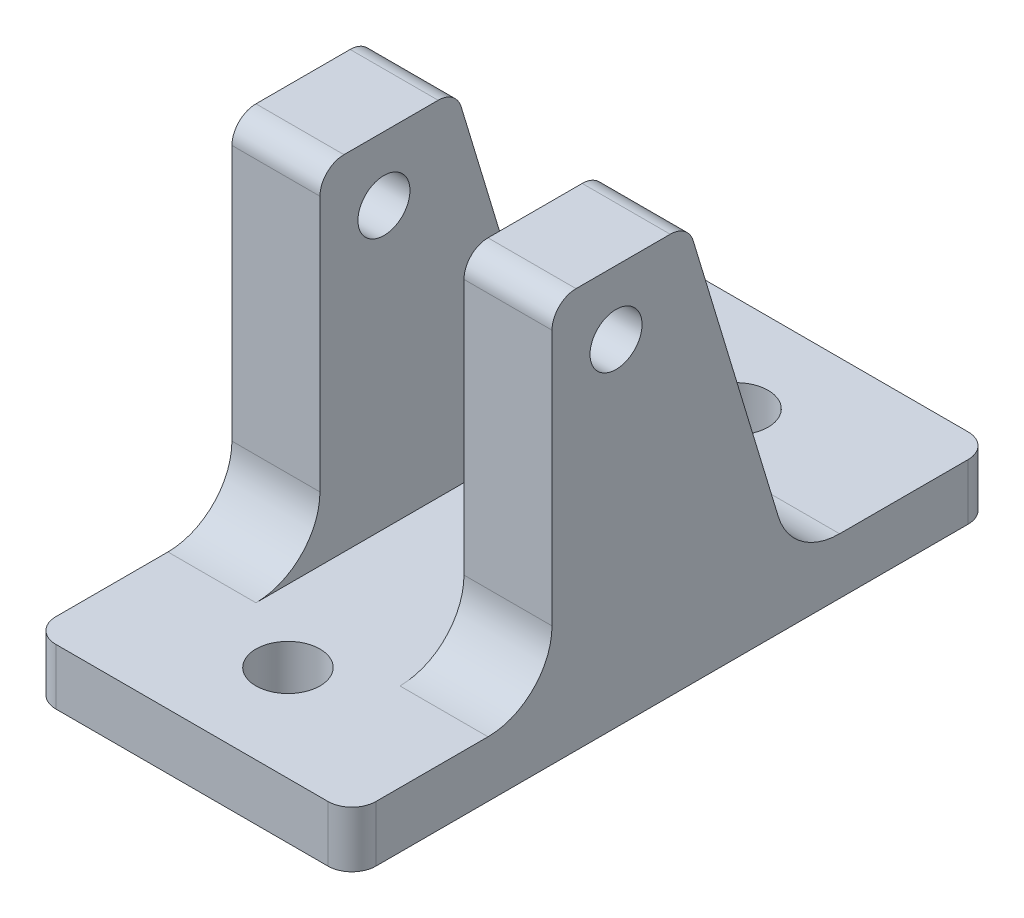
ISO-10303-21;
HEADER;
FILE_DESCRIPTION(('STEP AP214'),'2;1');
FILE_NAME('part.step','',(''),(''),'','','');
FILE_SCHEMA(('AUTOMOTIVE_DESIGN { 1 0 10303 214 1 1 1 1 }'));
ENDSEC;
DATA;
#1=APPLICATION_CONTEXT('core data for automotive mechanical design processes');
#2=APPLICATION_PROTOCOL_DEFINITION('international standard','automotive_design',2000,#1);
#3=PRODUCT_CONTEXT('',#1,'mechanical');
#4=PRODUCT('Part','Part','',(#3));
#5=PRODUCT_RELATED_PRODUCT_CATEGORY('part','',(#4));
#6=PRODUCT_DEFINITION_FORMATION('','',#4);
#7=PRODUCT_DEFINITION_CONTEXT('part definition',#1,'design');
#8=PRODUCT_DEFINITION('design','',#6,#7);
#9=PRODUCT_DEFINITION_SHAPE('','',#8);
#10=(LENGTH_UNIT() NAMED_UNIT(*) SI_UNIT(.MILLI.,.METRE.));
#11=(NAMED_UNIT(*) PLANE_ANGLE_UNIT() SI_UNIT($,.RADIAN.));
#12=(NAMED_UNIT(*) SI_UNIT($,.STERADIAN.) SOLID_ANGLE_UNIT());
#13=UNCERTAINTY_MEASURE_WITH_UNIT(LENGTH_MEASURE(1.E-05),#10,'distance_accuracy_value','');
#14=(GEOMETRIC_REPRESENTATION_CONTEXT(3) GLOBAL_UNCERTAINTY_ASSIGNED_CONTEXT((#13)) GLOBAL_UNIT_ASSIGNED_CONTEXT((#10,
#11,#12)) REPRESENTATION_CONTEXT('',''));
#15=CARTESIAN_POINT('',(0.,0.,0.));
#16=DIRECTION('',(0.,0.,1.));
#17=DIRECTION('',(1.,0.,0.));
#18=AXIS2_PLACEMENT_3D('',#15,#16,#17);
#19=CARTESIAN_POINT('',(0.,-505.422526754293,0.));
#20=DIRECTION('',(0.,-1.,0.));
#21=DIRECTION('',(0.,0.,-1.));
#22=AXIS2_PLACEMENT_3D('',#19,#20,#21);
#23=PLANE('',#22);
#24=CARTESIAN_POINT('',(-6.49999999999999,-505.422526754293,38.));
#25=DIRECTION('',(0.,-1.,0.));
#26=DIRECTION('',(1.,0.,0.));
#27=AXIS2_PLACEMENT_3D('',#24,#25,#26);
#28=CIRCLE('',#27,4.);
#29=CARTESIAN_POINT('',(-2.49999999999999,-505.422526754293,38.));
#30=VERTEX_POINT('',#29);
#31=EDGE_CURVE('E448',#30,#30,#28,.T.);
#32=ORIENTED_EDGE('',*,*,#31,.T.);
#33=EDGE_LOOP('',(#32));
#34=FACE_BOUND('',#33,.T.);
#35=DIRECTION('',(0.,0.,-1.));
#36=VECTOR('',#35,1.);
#37=CARTESIAN_POINT('',(-26.5,-505.422526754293,50.));
#38=LINE('',#37,#36);
#39=CARTESIAN_POINT('',(-26.5,-505.422526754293,47.));
#40=VERTEX_POINT('',#39);
#41=CARTESIAN_POINT('',(-26.5,-505.422526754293,33.));
#42=VERTEX_POINT('',#41);
#43=EDGE_CURVE('E223',#40,#42,#38,.T.);
#44=ORIENTED_EDGE('',*,*,#43,.F.);
#45=CARTESIAN_POINT('',(-23.5,-505.422526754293,47.));
#46=DIRECTION('',(0.,-1.,0.));
#47=DIRECTION('',(0.,0.,-1.));
#48=AXIS2_PLACEMENT_3D('',#45,#46,#47);
#49=CIRCLE('',#48,3.);
#50=CARTESIAN_POINT('',(-23.5,-505.422526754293,50.));
#51=VERTEX_POINT('',#50);
#52=EDGE_CURVE('E319',#40,#51,#49,.F.);
#53=ORIENTED_EDGE('',*,*,#52,.T.);
#54=DIRECTION('',(-1.,0.,0.));
#55=VECTOR('',#54,1.);
#56=CARTESIAN_POINT('',(-26.5,-505.422526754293,50.));
#57=LINE('',#56,#55);
#58=CARTESIAN_POINT('',(10.5,-505.422526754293,50.));
#59=VERTEX_POINT('',#58);
#60=EDGE_CURVE('E350',#59,#51,#57,.T.);
#61=ORIENTED_EDGE('',*,*,#60,.F.);
#62=CARTESIAN_POINT('',(10.5,-505.422526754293,47.));
#63=DIRECTION('',(0.,-1.,0.));
#64=DIRECTION('',(0.,0.,-1.));
#65=AXIS2_PLACEMENT_3D('',#62,#63,#64);
#66=CIRCLE('',#65,3.);
#67=CARTESIAN_POINT('',(13.5,-505.422526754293,47.));
#68=VERTEX_POINT('',#67);
#69=EDGE_CURVE('E318',#59,#68,#66,.F.);
#70=ORIENTED_EDGE('',*,*,#69,.T.);
#71=DIRECTION('',(0.,0.,1.));
#72=VECTOR('',#71,1.);
#73=CARTESIAN_POINT('',(13.5,-505.422526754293,50.));
#74=LINE('',#73,#72);
#75=CARTESIAN_POINT('',(13.5,-505.422526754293,33.));
#76=VERTEX_POINT('',#75);
#77=EDGE_CURVE('E360',#76,#68,#74,.T.);
#78=ORIENTED_EDGE('',*,*,#77,.F.);
#79=DIRECTION('',(1.,0.,0.));
#80=VECTOR('',#79,1.);
#81=CARTESIAN_POINT('',(2.50000000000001,-505.422526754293,33.));
#82=LINE('',#81,#80);
#83=CARTESIAN_POINT('',(2.50000000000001,-505.422526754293,33.));
#84=VERTEX_POINT('',#83);
#85=EDGE_CURVE('E243',#76,#84,#82,.F.);
#86=ORIENTED_EDGE('',*,*,#85,.T.);
#87=DIRECTION('',(0.,0.,-1.));
#88=VECTOR('',#87,1.);
#89=CARTESIAN_POINT('',(2.50000000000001,-505.422526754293,25.));
#90=LINE('',#89,#88);
#91=CARTESIAN_POINT('',(2.50000000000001,-505.422526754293,-10.9390055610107));
#92=VERTEX_POINT('',#91);
#93=EDGE_CURVE('E368',#84,#92,#90,.T.);
#94=ORIENTED_EDGE('',*,*,#93,.T.);
#95=DIRECTION('',(1.,0.,0.));
#96=VECTOR('',#95,1.);
#97=CARTESIAN_POINT('',(13.5,-505.422526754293,-10.9390055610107));
#98=LINE('',#97,#96);
#99=CARTESIAN_POINT('',(13.5,-505.422526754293,-10.9390055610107));
#100=VERTEX_POINT('',#99);
#101=EDGE_CURVE('E229',#92,#100,#98,.T.);
#102=ORIENTED_EDGE('',*,*,#101,.T.);
#103=DIRECTION('',(0.,0.,-1.));
#104=VECTOR('',#103,1.);
#105=CARTESIAN_POINT('',(13.5,-505.422526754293,-5.));
#106=LINE('',#105,#104);
#107=CARTESIAN_POINT('',(13.5,-505.422526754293,-27.));
#108=VERTEX_POINT('',#107);
#109=EDGE_CURVE('E423',#100,#108,#106,.T.);
#110=ORIENTED_EDGE('',*,*,#109,.T.);
#111=CARTESIAN_POINT('',(10.5,-505.422526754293,-27.));
#112=DIRECTION('',(0.,-1.,0.));
#113=DIRECTION('',(0.,0.,-1.));
#114=AXIS2_PLACEMENT_3D('',#111,#112,#113);
#115=CIRCLE('',#114,3.);
#116=CARTESIAN_POINT('',(10.5,-505.422526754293,-30.));
#117=VERTEX_POINT('',#116);
#118=EDGE_CURVE('E311',#108,#117,#115,.F.);
#119=ORIENTED_EDGE('',*,*,#118,.T.);
#120=DIRECTION('',(1.,0.,0.));
#121=VECTOR('',#120,1.);
#122=CARTESIAN_POINT('',(-26.5,-505.422526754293,-30.));
#123=LINE('',#122,#121);
#124=CARTESIAN_POINT('',(-23.5,-505.422526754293,-30.));
#125=VERTEX_POINT('',#124);
#126=EDGE_CURVE('E358',#125,#117,#123,.T.);
#127=ORIENTED_EDGE('',*,*,#126,.F.);
#128=CARTESIAN_POINT('',(-23.5,-505.422526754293,-27.));
#129=DIRECTION('',(0.,-1.,0.));
#130=DIRECTION('',(0.,0.,-1.));
#131=AXIS2_PLACEMENT_3D('',#128,#129,#130);
#132=CIRCLE('',#131,3.);
#133=CARTESIAN_POINT('',(-26.5,-505.422526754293,-27.));
#134=VERTEX_POINT('',#133);
#135=EDGE_CURVE('E316',#125,#134,#132,.F.);
#136=ORIENTED_EDGE('',*,*,#135,.T.);
#137=DIRECTION('',(0.,0.,-1.));
#138=VECTOR('',#137,1.);
#139=CARTESIAN_POINT('',(-26.5,-505.422526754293,-5.));
#140=LINE('',#139,#138);
#141=CARTESIAN_POINT('',(-26.5,-505.422526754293,-10.9390055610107));
#142=VERTEX_POINT('',#141);
#143=EDGE_CURVE('E412',#142,#134,#140,.T.);
#144=ORIENTED_EDGE('',*,*,#143,.F.);
#145=DIRECTION('',(1.,0.,0.));
#146=VECTOR('',#145,1.);
#147=CARTESIAN_POINT('',(-15.5,-505.422526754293,-10.9390055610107));
#148=LINE('',#147,#146);
#149=CARTESIAN_POINT('',(-15.5,-505.422526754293,-10.9390055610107));
#150=VERTEX_POINT('',#149);
#151=EDGE_CURVE('E234',#142,#150,#148,.T.);
#152=ORIENTED_EDGE('',*,*,#151,.T.);
#153=DIRECTION('',(0.,0.,-1.));
#154=VECTOR('',#153,1.);
#155=CARTESIAN_POINT('',(-15.5,-505.422526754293,25.));
#156=LINE('',#155,#154);
#157=CARTESIAN_POINT('',(-15.5,-505.422526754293,33.));
#158=VERTEX_POINT('',#157);
#159=EDGE_CURVE('E432',#158,#150,#156,.T.);
#160=ORIENTED_EDGE('',*,*,#159,.F.);
#161=DIRECTION('',(1.,0.,0.));
#162=VECTOR('',#161,1.);
#163=CARTESIAN_POINT('',(0.,-505.422526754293,33.));
#164=LINE('',#163,#162);
#165=EDGE_CURVE('E248',#158,#42,#164,.F.);
#166=ORIENTED_EDGE('',*,*,#165,.T.);
#167=EDGE_LOOP('',(#44,#53,#61,#70,#78,#86,#94,#102,#110,#119,#127,#136,#144,#152,#160,#166));
#168=FACE_BOUND('',#167,.T.);
#169=CARTESIAN_POINT('',(-6.49999999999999,-505.422526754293,-18.));
#170=DIRECTION('',(0.,-1.,0.));
#171=DIRECTION('',(1.,0.,0.));
#172=AXIS2_PLACEMENT_3D('',#169,#170,#171);
#173=CIRCLE('',#172,4.);
#174=CARTESIAN_POINT('',(-2.49999999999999,-505.422526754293,-18.));
#175=VERTEX_POINT('',#174);
#176=EDGE_CURVE('E445',#175,#175,#173,.T.);
#177=ORIENTED_EDGE('',*,*,#176,.T.);
#178=EDGE_LOOP('',(#177));
#179=FACE_BOUND('',#178,.T.);
#180=ADVANCED_FACE('F39',(#34,#168,#179),#23,.F.);
#181=CARTESIAN_POINT('',(2.50000000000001,-462.422526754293,25.));
#182=DIRECTION('',(0.,1.,0.));
#183=DIRECTION('',(0.,0.,1.));
#184=AXIS2_PLACEMENT_3D('',#181,#182,#183);
#185=PLANE('',#184);
#186=DIRECTION('',(0.,0.,-1.));
#187=VECTOR('',#186,1.);
#188=CARTESIAN_POINT('',(2.50000000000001,-462.422526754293,25.));
#189=LINE('',#188,#187);
#190=CARTESIAN_POINT('',(2.50000000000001,-462.422526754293,22.));
#191=VERTEX_POINT('',#190);
#192=CARTESIAN_POINT('',(2.50000000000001,-462.422526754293,10.227127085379));
#193=VERTEX_POINT('',#192);
#194=EDGE_CURVE('E369',#191,#193,#189,.T.);
#195=ORIENTED_EDGE('',*,*,#194,.F.);
#196=DIRECTION('',(1.,0.,0.));
#197=VECTOR('',#196,1.);
#198=CARTESIAN_POINT('',(13.5,-462.422526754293,22.));
#199=LINE('',#198,#197);
#200=CARTESIAN_POINT('',(13.5,-462.422526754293,22.));
#201=VERTEX_POINT('',#200);
#202=EDGE_CURVE('E293',#191,#201,#199,.T.);
#203=ORIENTED_EDGE('',*,*,#202,.T.);
#204=DIRECTION('',(0.,0.,-1.));
#205=VECTOR('',#204,1.);
#206=CARTESIAN_POINT('',(13.5,-462.422526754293,25.));
#207=LINE('',#206,#205);
#208=CARTESIAN_POINT('',(13.5,-462.422526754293,10.227127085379));
#209=VERTEX_POINT('',#208);
#210=EDGE_CURVE('E361',#201,#209,#207,.T.);
#211=ORIENTED_EDGE('',*,*,#210,.T.);
#212=DIRECTION('',(1.,0.,0.));
#213=VECTOR('',#212,1.);
#214=CARTESIAN_POINT('',(2.5,-462.422526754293,10.227127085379));
#215=LINE('',#214,#213);
#216=EDGE_CURVE('E291',#209,#193,#215,.F.);
#217=ORIENTED_EDGE('',*,*,#216,.T.);
#218=EDGE_LOOP('',(#195,#203,#211,#217));
#219=FACE_BOUND('',#218,.T.);
#220=ADVANCED_FACE('F397',(#219),#185,.T.);
#221=CARTESIAN_POINT('',(2.50000000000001,-505.422526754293,25.));
#222=DIRECTION('',(-1.,0.,0.));
#223=DIRECTION('',(0.,0.,1.));
#224=AXIS2_PLACEMENT_3D('',#221,#222,#223);
#225=PLANE('',#224);
#226=DIRECTION('',(0.,1.,0.));
#227=VECTOR('',#226,1.);
#228=CARTESIAN_POINT('',(2.50000000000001,-505.422526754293,25.));
#229=LINE('',#228,#227);
#230=CARTESIAN_POINT('',(2.50000000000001,-497.422526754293,25.));
#231=VERTEX_POINT('',#230);
#232=CARTESIAN_POINT('',(2.50000000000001,-465.422526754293,25.));
#233=VERTEX_POINT('',#232);
#234=EDGE_CURVE('E370',#231,#233,#229,.T.);
#235=ORIENTED_EDGE('',*,*,#234,.T.);
#236=CARTESIAN_POINT('',(2.50000000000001,-465.422526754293,22.));
#237=DIRECTION('',(-1.,0.,0.));
#238=DIRECTION('',(0.,0.,1.));
#239=AXIS2_PLACEMENT_3D('',#236,#237,#238);
#240=CIRCLE('',#239,3.);
#241=EDGE_CURVE('E309',#233,#191,#240,.T.);
#242=ORIENTED_EDGE('',*,*,#241,.T.);
#243=ORIENTED_EDGE('',*,*,#194,.T.);
#244=CARTESIAN_POINT('',(2.50000000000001,-465.422526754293,10.227127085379));
#245=DIRECTION('',(-1.,0.,0.));
#246=DIRECTION('',(0.,0.,1.));
#247=AXIS2_PLACEMENT_3D('',#244,#245,#246);
#248=CIRCLE('',#247,3.);
#249=CARTESIAN_POINT('',(2.50000000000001,-464.554358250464,7.35549280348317));
#250=VERTEX_POINT('',#249);
#251=EDGE_CURVE('E310',#193,#250,#248,.T.);
#252=ORIENTED_EDGE('',*,*,#251,.T.);
#253=DIRECTION('',(0.,0.957211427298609,0.289389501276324));
#254=VECTOR('',#253,1.);
#255=CARTESIAN_POINT('',(2.50000000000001,-497.112318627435,-2.48761149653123));
#256=LINE('',#255,#254);
#257=CARTESIAN_POINT('',(2.50000000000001,-499.737642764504,-3.28131414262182));
#258=VERTEX_POINT('',#257);
#259=EDGE_CURVE('E413',#258,#250,#256,.T.);
#260=ORIENTED_EDGE('',*,*,#259,.F.);
#261=CARTESIAN_POINT('',(2.50000000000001,-497.422526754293,-10.9390055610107));
#262=DIRECTION('',(-1.,0.,0.));
#263=DIRECTION('',(0.,0.,1.));
#264=AXIS2_PLACEMENT_3D('',#261,#262,#263);
#265=CIRCLE('',#264,8.);
#266=EDGE_CURVE('E270',#258,#92,#265,.F.);
#267=ORIENTED_EDGE('',*,*,#266,.T.);
#268=ORIENTED_EDGE('',*,*,#93,.F.);
#269=CARTESIAN_POINT('',(2.50000000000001,-497.422526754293,33.));
#270=DIRECTION('',(-1.,0.,0.));
#271=DIRECTION('',(0.,0.,1.));
#272=AXIS2_PLACEMENT_3D('',#269,#270,#271);
#273=CIRCLE('',#272,8.);
#274=EDGE_CURVE('E256',#84,#231,#273,.F.);
#275=ORIENTED_EDGE('',*,*,#274,.T.);
#276=EDGE_LOOP('',(#235,#242,#243,#252,#260,#267,#268,#275));
#277=FACE_BOUND('',#276,.T.);
#278=CARTESIAN_POINT('',(2.50000000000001,-470.422526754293,17.));
#279=DIRECTION('',(-1.,0.,0.));
#280=DIRECTION('',(0.,0.,1.));
#281=AXIS2_PLACEMENT_3D('',#278,#279,#280);
#282=CIRCLE('',#281,3.25);
#283=CARTESIAN_POINT('',(2.50000000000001,-470.422526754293,20.25));
#284=VERTEX_POINT('',#283);
#285=EDGE_CURVE('E436',#284,#284,#282,.T.);
#286=ORIENTED_EDGE('',*,*,#285,.F.);
#287=EDGE_LOOP('',(#286));
#288=FACE_BOUND('',#287,.T.);
#289=ADVANCED_FACE('F395',(#277,#288),#225,.T.);
#290=CARTESIAN_POINT('',(13.5,-462.422526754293,25.));
#291=DIRECTION('',(1.,0.,0.));
#292=DIRECTION('',(0.,1.,0.));
#293=AXIS2_PLACEMENT_3D('',#290,#291,#292);
#294=PLANE('',#293);
#295=ORIENTED_EDGE('',*,*,#210,.F.);
#296=CARTESIAN_POINT('',(13.5,-465.422526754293,22.));
#297=DIRECTION('',(1.,0.,0.));
#298=DIRECTION('',(0.,1.,0.));
#299=AXIS2_PLACEMENT_3D('',#296,#297,#298);
#300=CIRCLE('',#299,3.);
#301=CARTESIAN_POINT('',(13.5,-465.422526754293,25.));
#302=VERTEX_POINT('',#301);
#303=EDGE_CURVE('E301',#201,#302,#300,.T.);
#304=ORIENTED_EDGE('',*,*,#303,.T.);
#305=DIRECTION('',(0.,-1.,0.));
#306=VECTOR('',#305,1.);
#307=CARTESIAN_POINT('',(13.5,-462.422526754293,25.));
#308=LINE('',#307,#306);
#309=CARTESIAN_POINT('',(13.5,-497.422526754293,25.));
#310=VERTEX_POINT('',#309);
#311=EDGE_CURVE('E240',#302,#310,#308,.T.);
#312=ORIENTED_EDGE('',*,*,#311,.T.);
#313=CARTESIAN_POINT('',(13.5,-497.422526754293,33.));
#314=DIRECTION('',(1.,0.,0.));
#315=DIRECTION('',(0.,1.,0.));
#316=AXIS2_PLACEMENT_3D('',#313,#314,#315);
#317=CIRCLE('',#316,8.);
#318=EDGE_CURVE('E224',#310,#76,#317,.F.);
#319=ORIENTED_EDGE('',*,*,#318,.T.);
#320=ORIENTED_EDGE('',*,*,#77,.T.);
#321=DIRECTION('',(0.,1.,0.));
#322=VECTOR('',#321,1.);
#323=CARTESIAN_POINT('',(13.5,-512.422526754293,47.));
#324=LINE('',#323,#322);
#325=CARTESIAN_POINT('',(13.5,-512.422526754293,47.));
#326=VERTEX_POINT('',#325);
#327=EDGE_CURVE('E297',#68,#326,#324,.F.);
#328=ORIENTED_EDGE('',*,*,#327,.T.);
#329=DIRECTION('',(0.,0.,1.));
#330=VECTOR('',#329,1.);
#331=CARTESIAN_POINT('',(13.5,-512.422526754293,50.));
#332=LINE('',#331,#330);
#333=CARTESIAN_POINT('',(13.5,-512.422526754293,-27.));
#334=VERTEX_POINT('',#333);
#335=EDGE_CURVE('E454',#334,#326,#332,.T.);
#336=ORIENTED_EDGE('',*,*,#335,.F.);
#337=DIRECTION('',(0.,1.,0.));
#338=VECTOR('',#337,1.);
#339=CARTESIAN_POINT('',(13.5,-505.422526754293,-27.));
#340=LINE('',#339,#338);
#341=EDGE_CURVE('E298',#334,#108,#340,.T.);
#342=ORIENTED_EDGE('',*,*,#341,.T.);
#343=ORIENTED_EDGE('',*,*,#109,.F.);
#344=CARTESIAN_POINT('',(13.5,-497.422526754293,-10.9390055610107));
#345=DIRECTION('',(1.,0.,0.));
#346=DIRECTION('',(0.,1.,0.));
#347=AXIS2_PLACEMENT_3D('',#344,#345,#346);
#348=CIRCLE('',#347,8.);
#349=CARTESIAN_POINT('',(13.5,-499.737642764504,-3.28131414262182));
#350=VERTEX_POINT('',#349);
#351=EDGE_CURVE('E264',#100,#350,#348,.F.);
#352=ORIENTED_EDGE('',*,*,#351,.T.);
#353=DIRECTION('',(0.,-0.957211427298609,-0.289389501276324));
#354=VECTOR('',#353,1.);
#355=CARTESIAN_POINT('',(13.5,-462.422526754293,8.));
#356=LINE('',#355,#354);
#357=CARTESIAN_POINT('',(13.5,-464.554358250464,7.35549280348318));
#358=VERTEX_POINT('',#357);
#359=EDGE_CURVE('E405',#358,#350,#356,.T.);
#360=ORIENTED_EDGE('',*,*,#359,.F.);
#361=CARTESIAN_POINT('',(13.5,-465.422526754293,10.227127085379));
#362=DIRECTION('',(1.,0.,0.));
#363=DIRECTION('',(0.,1.,0.));
#364=AXIS2_PLACEMENT_3D('',#361,#362,#363);
#365=CIRCLE('',#364,3.);
#366=EDGE_CURVE('E303',#358,#209,#365,.T.);
#367=ORIENTED_EDGE('',*,*,#366,.T.);
#368=EDGE_LOOP('',(#295,#304,#312,#319,#320,#328,#336,#342,#343,#352,#360,#367));
#369=FACE_BOUND('',#368,.T.);
#370=CARTESIAN_POINT('',(13.5000000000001,-470.422526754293,17.));
#371=DIRECTION('',(1.,0.,0.));
#372=DIRECTION('',(0.,1.,0.));
#373=AXIS2_PLACEMENT_3D('',#370,#371,#372);
#374=CIRCLE('',#373,3.25);
#375=CARTESIAN_POINT('',(13.5000000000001,-467.172526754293,17.));
#376=VERTEX_POINT('',#375);
#377=EDGE_CURVE('E429',#376,#376,#374,.T.);
#378=ORIENTED_EDGE('',*,*,#377,.F.);
#379=EDGE_LOOP('',(#378));
#380=FACE_BOUND('',#379,.T.);
#381=ADVANCED_FACE('F376',(#369,#380),#294,.T.);
#382=CARTESIAN_POINT('',(0.,0.,25.));
#383=DIRECTION('',(0.,0.,-1.));
#384=DIRECTION('',(-1.,0.,0.));
#385=AXIS2_PLACEMENT_3D('',#382,#383,#384);
#386=PLANE('',#385);
#387=ORIENTED_EDGE('',*,*,#311,.F.);
#388=DIRECTION('',(1.,0.,0.));
#389=VECTOR('',#388,1.);
#390=CARTESIAN_POINT('',(2.50000000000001,-465.422526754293,25.));
#391=LINE('',#390,#389);
#392=EDGE_CURVE('E304',#302,#233,#391,.F.);
#393=ORIENTED_EDGE('',*,*,#392,.T.);
#394=ORIENTED_EDGE('',*,*,#234,.F.);
#395=DIRECTION('',(1.,0.,0.));
#396=VECTOR('',#395,1.);
#397=CARTESIAN_POINT('',(13.5,-497.422526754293,25.));
#398=LINE('',#397,#396);
#399=EDGE_CURVE('E246',#231,#310,#398,.T.);
#400=ORIENTED_EDGE('',*,*,#399,.T.);
#401=EDGE_LOOP('',(#387,#393,#394,#400));
#402=FACE_BOUND('',#401,.T.);
#403=ADVANCED_FACE('F386',(#402),#386,.F.);
#404=CARTESIAN_POINT('',(0.,-512.422526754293,0.));
#405=DIRECTION('',(0.,-1.,0.));
#406=DIRECTION('',(0.,0.,-1.));
#407=AXIS2_PLACEMENT_3D('',#404,#405,#406);
#408=PLANE('',#407);
#409=CARTESIAN_POINT('',(-6.49999999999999,-512.422526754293,38.));
#410=DIRECTION('',(0.,-1.,0.));
#411=DIRECTION('',(1.,0.,0.));
#412=AXIS2_PLACEMENT_3D('',#409,#410,#411);
#413=CIRCLE('',#412,4.);
#414=CARTESIAN_POINT('',(-2.49999999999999,-512.422526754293,38.));
#415=VERTEX_POINT('',#414);
#416=EDGE_CURVE('E447',#415,#415,#413,.T.);
#417=ORIENTED_EDGE('',*,*,#416,.F.);
#418=EDGE_LOOP('',(#417));
#419=FACE_BOUND('',#418,.T.);
#420=DIRECTION('',(-1.,0.,0.));
#421=VECTOR('',#420,1.);
#422=CARTESIAN_POINT('',(-26.5,-512.422526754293,50.));
#423=LINE('',#422,#421);
#424=CARTESIAN_POINT('',(10.5,-512.422526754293,50.));
#425=VERTEX_POINT('',#424);
#426=CARTESIAN_POINT('',(-23.5,-512.422526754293,50.));
#427=VERTEX_POINT('',#426);
#428=EDGE_CURVE('E337',#425,#427,#423,.T.);
#429=ORIENTED_EDGE('',*,*,#428,.T.);
#430=CARTESIAN_POINT('',(-23.5,-512.422526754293,47.));
#431=DIRECTION('',(0.,-1.,0.));
#432=DIRECTION('',(0.,0.,-1.));
#433=AXIS2_PLACEMENT_3D('',#430,#431,#432);
#434=CIRCLE('',#433,3.);
#435=CARTESIAN_POINT('',(-26.5,-512.422526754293,47.));
#436=VERTEX_POINT('',#435);
#437=EDGE_CURVE('E332',#427,#436,#434,.T.);
#438=ORIENTED_EDGE('',*,*,#437,.T.);
#439=DIRECTION('',(0.,0.,-1.));
#440=VECTOR('',#439,1.);
#441=CARTESIAN_POINT('',(-26.5,-512.422526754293,50.));
#442=LINE('',#441,#440);
#443=CARTESIAN_POINT('',(-26.5,-512.422526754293,-27.));
#444=VERTEX_POINT('',#443);
#445=EDGE_CURVE('E336',#436,#444,#442,.T.);
#446=ORIENTED_EDGE('',*,*,#445,.T.);
#447=CARTESIAN_POINT('',(-23.5,-512.422526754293,-27.));
#448=DIRECTION('',(0.,-1.,0.));
#449=DIRECTION('',(0.,0.,-1.));
#450=AXIS2_PLACEMENT_3D('',#447,#448,#449);
#451=CIRCLE('',#450,3.);
#452=CARTESIAN_POINT('',(-23.5,-512.422526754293,-30.));
#453=VERTEX_POINT('',#452);
#454=EDGE_CURVE('E58',#444,#453,#451,.T.);
#455=ORIENTED_EDGE('',*,*,#454,.T.);
#456=DIRECTION('',(1.,0.,0.));
#457=VECTOR('',#456,1.);
#458=CARTESIAN_POINT('',(-26.5,-512.422526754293,-30.));
#459=LINE('',#458,#457);
#460=CARTESIAN_POINT('',(10.5,-512.422526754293,-30.));
#461=VERTEX_POINT('',#460);
#462=EDGE_CURVE('E346',#453,#461,#459,.T.);
#463=ORIENTED_EDGE('',*,*,#462,.T.);
#464=CARTESIAN_POINT('',(10.5,-512.422526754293,-27.));
#465=DIRECTION('',(0.,-1.,0.));
#466=DIRECTION('',(0.,0.,-1.));
#467=AXIS2_PLACEMENT_3D('',#464,#465,#466);
#468=CIRCLE('',#467,3.);
#469=EDGE_CURVE('E330',#461,#334,#468,.T.);
#470=ORIENTED_EDGE('',*,*,#469,.T.);
#471=ORIENTED_EDGE('',*,*,#335,.T.);
#472=CARTESIAN_POINT('',(10.5,-512.422526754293,47.));
#473=DIRECTION('',(0.,-1.,0.));
#474=DIRECTION('',(0.,0.,-1.));
#475=AXIS2_PLACEMENT_3D('',#472,#473,#474);
#476=CIRCLE('',#475,3.);
#477=EDGE_CURVE('E329',#326,#425,#476,.T.);
#478=ORIENTED_EDGE('',*,*,#477,.T.);
#479=EDGE_LOOP('',(#429,#438,#446,#455,#463,#470,#471,#478));
#480=FACE_BOUND('',#479,.T.);
#481=CARTESIAN_POINT('',(-6.49999999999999,-512.422526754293,-18.));
#482=DIRECTION('',(0.,-1.,0.));
#483=DIRECTION('',(1.,0.,0.));
#484=AXIS2_PLACEMENT_3D('',#481,#482,#483);
#485=CIRCLE('',#484,4.);
#486=CARTESIAN_POINT('',(-2.49999999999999,-512.422526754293,-18.));
#487=VERTEX_POINT('',#486);
#488=EDGE_CURVE('E443',#487,#487,#485,.T.);
#489=ORIENTED_EDGE('',*,*,#488,.F.);
#490=EDGE_LOOP('',(#489));
#491=FACE_BOUND('',#490,.T.);
#492=ADVANCED_FACE('F338',(#419,#480,#491),#408,.T.);
#493=CARTESIAN_POINT('',(-26.5,-512.422526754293,50.));
#494=DIRECTION('',(1.,0.,0.));
#495=DIRECTION('',(0.,1.,0.));
#496=AXIS2_PLACEMENT_3D('',#493,#494,#495);
#497=PLANE('',#496);
#498=DIRECTION('',(0.,-1.,0.));
#499=VECTOR('',#498,1.);
#500=CARTESIAN_POINT('',(-26.5,-462.422526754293,25.));
#501=LINE('',#500,#499);
#502=CARTESIAN_POINT('',(-26.5,-465.422526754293,25.));
#503=VERTEX_POINT('',#502);
#504=CARTESIAN_POINT('',(-26.5,-497.422526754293,25.));
#505=VERTEX_POINT('',#504);
#506=EDGE_CURVE('E201',#503,#505,#501,.T.);
#507=ORIENTED_EDGE('',*,*,#506,.F.);
#508=CARTESIAN_POINT('',(-26.5,-465.422526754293,22.));
#509=DIRECTION('',(1.,0.,0.));
#510=DIRECTION('',(0.,1.,0.));
#511=AXIS2_PLACEMENT_3D('',#508,#509,#510);
#512=CIRCLE('',#511,3.);
#513=CARTESIAN_POINT('',(-26.5,-462.422526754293,22.));
#514=VERTEX_POINT('',#513);
#515=EDGE_CURVE('E287',#503,#514,#512,.F.);
#516=ORIENTED_EDGE('',*,*,#515,.T.);
#517=DIRECTION('',(0.,0.,-1.));
#518=VECTOR('',#517,1.);
#519=CARTESIAN_POINT('',(-26.5,-462.422526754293,25.));
#520=LINE('',#519,#518);
#521=CARTESIAN_POINT('',(-26.5,-462.422526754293,10.227127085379));
#522=VERTEX_POINT('',#521);
#523=EDGE_CURVE('E430',#514,#522,#520,.T.);
#524=ORIENTED_EDGE('',*,*,#523,.T.);
#525=CARTESIAN_POINT('',(-26.5,-465.422526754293,10.227127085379));
#526=DIRECTION('',(1.,0.,0.));
#527=DIRECTION('',(0.,1.,0.));
#528=AXIS2_PLACEMENT_3D('',#525,#526,#527);
#529=CIRCLE('',#528,3.);
#530=CARTESIAN_POINT('',(-26.5,-464.554358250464,7.35549280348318));
#531=VERTEX_POINT('',#530);
#532=EDGE_CURVE('E281',#522,#531,#529,.F.);
#533=ORIENTED_EDGE('',*,*,#532,.T.);
#534=DIRECTION('',(0.,-0.957211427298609,-0.289389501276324));
#535=VECTOR('',#534,1.);
#536=CARTESIAN_POINT('',(-26.5,-462.422526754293,8.));
#537=LINE('',#536,#535);
#538=CARTESIAN_POINT('',(-26.5,-499.737642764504,-3.28131414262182));
#539=VERTEX_POINT('',#538);
#540=EDGE_CURVE('E419',#531,#539,#537,.T.);
#541=ORIENTED_EDGE('',*,*,#540,.T.);
#542=CARTESIAN_POINT('',(-26.5,-497.422526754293,-10.9390055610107));
#543=DIRECTION('',(1.,0.,0.));
#544=DIRECTION('',(0.,1.,0.));
#545=AXIS2_PLACEMENT_3D('',#542,#543,#544);
#546=CIRCLE('',#545,8.);
#547=EDGE_CURVE('E265',#539,#142,#546,.T.);
#548=ORIENTED_EDGE('',*,*,#547,.T.);
#549=ORIENTED_EDGE('',*,*,#143,.T.);
#550=DIRECTION('',(0.,1.,0.));
#551=VECTOR('',#550,1.);
#552=CARTESIAN_POINT('',(-26.5,-512.422526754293,-27.));
#553=LINE('',#552,#551);
#554=EDGE_CURVE('E279',#134,#444,#553,.F.);
#555=ORIENTED_EDGE('',*,*,#554,.T.);
#556=ORIENTED_EDGE('',*,*,#445,.F.);
#557=DIRECTION('',(0.,1.,0.));
#558=VECTOR('',#557,1.);
#559=CARTESIAN_POINT('',(-26.5,-512.422526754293,47.));
#560=LINE('',#559,#558);
#561=EDGE_CURVE('E285',#436,#40,#560,.T.);
#562=ORIENTED_EDGE('',*,*,#561,.T.);
#563=ORIENTED_EDGE('',*,*,#43,.T.);
#564=CARTESIAN_POINT('',(-26.5,-497.422526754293,33.));
#565=DIRECTION('',(1.,0.,0.));
#566=DIRECTION('',(0.,1.,0.));
#567=AXIS2_PLACEMENT_3D('',#564,#565,#566);
#568=CIRCLE('',#567,8.);
#569=EDGE_CURVE('E216',#42,#505,#568,.T.);
#570=ORIENTED_EDGE('',*,*,#569,.T.);
#571=EDGE_LOOP('',(#507,#516,#524,#533,#541,#548,#549,#555,#556,#562,#563,#570));
#572=FACE_BOUND('',#571,.T.);
#573=CARTESIAN_POINT('',(-26.5,-470.422526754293,17.));
#574=DIRECTION('',(1.,0.,0.));
#575=DIRECTION('',(0.,1.,0.));
#576=AXIS2_PLACEMENT_3D('',#573,#574,#575);
#577=CIRCLE('',#576,3.25);
#578=CARTESIAN_POINT('',(-26.5,-467.172526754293,17.));
#579=VERTEX_POINT('',#578);
#580=EDGE_CURVE('E414',#579,#579,#577,.T.);
#581=ORIENTED_EDGE('',*,*,#580,.T.);
#582=EDGE_LOOP('',(#581));
#583=FACE_BOUND('',#582,.T.);
#584=ADVANCED_FACE('F220',(#572,#583),#497,.F.);
#585=CARTESIAN_POINT('',(-26.5,-512.422526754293,-30.));
#586=DIRECTION('',(0.,0.,1.));
#587=DIRECTION('',(1.,0.,0.));
#588=AXIS2_PLACEMENT_3D('',#585,#586,#587);
#589=PLANE('',#588);
#590=ORIENTED_EDGE('',*,*,#462,.F.);
#591=DIRECTION('',(0.,1.,0.));
#592=VECTOR('',#591,1.);
#593=CARTESIAN_POINT('',(-23.5,-512.422526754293,-30.));
#594=LINE('',#593,#592);
#595=EDGE_CURVE('E11',#453,#125,#594,.T.);
#596=ORIENTED_EDGE('',*,*,#595,.T.);
#597=ORIENTED_EDGE('',*,*,#126,.T.);
#598=DIRECTION('',(0.,1.,0.));
#599=VECTOR('',#598,1.);
#600=CARTESIAN_POINT('',(10.5,-512.422526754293,-30.));
#601=LINE('',#600,#599);
#602=EDGE_CURVE('E50',#117,#461,#601,.F.);
#603=ORIENTED_EDGE('',*,*,#602,.T.);
#604=EDGE_LOOP('',(#590,#596,#597,#603));
#605=FACE_BOUND('',#604,.T.);
#606=ADVANCED_FACE('F458',(#605),#589,.F.);
#607=CARTESIAN_POINT('',(-26.5,-512.422526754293,50.));
#608=DIRECTION('',(0.,0.,-1.));
#609=DIRECTION('',(-1.,0.,0.));
#610=AXIS2_PLACEMENT_3D('',#607,#608,#609);
#611=PLANE('',#610);
#612=ORIENTED_EDGE('',*,*,#60,.T.);
#613=DIRECTION('',(0.,1.,0.));
#614=VECTOR('',#613,1.);
#615=CARTESIAN_POINT('',(-23.5,-512.422526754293,50.));
#616=LINE('',#615,#614);
#617=EDGE_CURVE('E324',#51,#427,#616,.F.);
#618=ORIENTED_EDGE('',*,*,#617,.T.);
#619=ORIENTED_EDGE('',*,*,#428,.F.);
#620=DIRECTION('',(0.,1.,0.));
#621=VECTOR('',#620,1.);
#622=CARTESIAN_POINT('',(10.5,-505.422526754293,50.));
#623=LINE('',#622,#621);
#624=EDGE_CURVE('E325',#425,#59,#623,.T.);
#625=ORIENTED_EDGE('',*,*,#624,.T.);
#626=EDGE_LOOP('',(#612,#618,#619,#625));
#627=FACE_BOUND('',#626,.T.);
#628=ADVANCED_FACE('F354',(#627),#611,.F.);
#629=CARTESIAN_POINT('',(-6.49999999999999,-512.422526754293,38.));
#630=DIRECTION('',(0.,1.,0.));
#631=DIRECTION('',(-1.,0.,0.));
#632=AXIS2_PLACEMENT_3D('',#629,#630,#631);
#633=CYLINDRICAL_SURFACE('',#632,4.);
#634=ORIENTED_EDGE('',*,*,#416,.T.);
#635=EDGE_LOOP('',(#634));
#636=FACE_BOUND('',#635,.T.);
#637=ORIENTED_EDGE('',*,*,#31,.F.);
#638=EDGE_LOOP('',(#637));
#639=FACE_BOUND('',#638,.T.);
#640=ADVANCED_FACE('F508',(#636,#639),#633,.F.);
#641=CARTESIAN_POINT('',(-6.49999999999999,-512.422526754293,-18.));
#642=DIRECTION('',(0.,1.,0.));
#643=DIRECTION('',(-1.,0.,0.));
#644=AXIS2_PLACEMENT_3D('',#641,#642,#643);
#645=CYLINDRICAL_SURFACE('',#644,4.);
#646=ORIENTED_EDGE('',*,*,#488,.T.);
#647=EDGE_LOOP('',(#646));
#648=FACE_BOUND('',#647,.T.);
#649=ORIENTED_EDGE('',*,*,#176,.F.);
#650=EDGE_LOOP('',(#649));
#651=FACE_BOUND('',#650,.T.);
#652=ADVANCED_FACE('F671',(#648,#651),#645,.F.);
#653=CARTESIAN_POINT('',(-26.5,-470.422526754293,17.));
#654=DIRECTION('',(1.,0.,0.));
#655=DIRECTION('',(0.,1.,0.));
#656=AXIS2_PLACEMENT_3D('',#653,#654,#655);
#657=CYLINDRICAL_SURFACE('',#656,3.25);
#658=ORIENTED_EDGE('',*,*,#285,.T.);
#659=EDGE_LOOP('',(#658));
#660=FACE_BOUND('',#659,.T.);
#661=ORIENTED_EDGE('',*,*,#377,.T.);
#662=EDGE_LOOP('',(#661));
#663=FACE_BOUND('',#662,.T.);
#664=ADVANCED_FACE('F665',(#660,#663),#657,.F.);
#665=CARTESIAN_POINT('',(-26.5,-462.422526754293,25.));
#666=DIRECTION('',(0.,1.,0.));
#667=DIRECTION('',(0.,0.,1.));
#668=AXIS2_PLACEMENT_3D('',#665,#666,#667);
#669=PLANE('',#668);
#670=ORIENTED_EDGE('',*,*,#523,.F.);
#671=DIRECTION('',(1.,0.,0.));
#672=VECTOR('',#671,1.);
#673=CARTESIAN_POINT('',(-26.5,-462.422526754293,22.));
#674=LINE('',#673,#672);
#675=CARTESIAN_POINT('',(-15.5,-462.422526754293,22.));
#676=VERTEX_POINT('',#675);
#677=EDGE_CURVE('E275',#514,#676,#674,.T.);
#678=ORIENTED_EDGE('',*,*,#677,.T.);
#679=DIRECTION('',(0.,0.,-1.));
#680=VECTOR('',#679,1.);
#681=CARTESIAN_POINT('',(-15.5,-462.422526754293,25.));
#682=LINE('',#681,#680);
#683=CARTESIAN_POINT('',(-15.5,-462.422526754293,10.227127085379));
#684=VERTEX_POINT('',#683);
#685=EDGE_CURVE('E215',#676,#684,#682,.T.);
#686=ORIENTED_EDGE('',*,*,#685,.T.);
#687=DIRECTION('',(1.,0.,0.));
#688=VECTOR('',#687,1.);
#689=CARTESIAN_POINT('',(-26.5,-462.422526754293,10.227127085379));
#690=LINE('',#689,#688);
#691=EDGE_CURVE('E269',#684,#522,#690,.F.);
#692=ORIENTED_EDGE('',*,*,#691,.T.);
#693=EDGE_LOOP('',(#670,#678,#686,#692));
#694=FACE_BOUND('',#693,.T.);
#695=ADVANCED_FACE('F649',(#694),#669,.T.);
#696=CARTESIAN_POINT('',(-15.5,-505.422526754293,25.));
#697=DIRECTION('',(-1.,0.,0.));
#698=DIRECTION('',(0.,0.,1.));
#699=AXIS2_PLACEMENT_3D('',#696,#697,#698);
#700=PLANE('',#699);
#701=CARTESIAN_POINT('',(-15.5,-470.422526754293,17.));
#702=DIRECTION('',(-1.,0.,0.));
#703=DIRECTION('',(0.,0.,1.));
#704=AXIS2_PLACEMENT_3D('',#701,#702,#703);
#705=CIRCLE('',#704,3.25);
#706=CARTESIAN_POINT('',(-15.5,-470.422526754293,20.25));
#707=VERTEX_POINT('',#706);
#708=EDGE_CURVE('E418',#707,#707,#705,.T.);
#709=ORIENTED_EDGE('',*,*,#708,.T.);
#710=EDGE_LOOP('',(#709));
#711=FACE_BOUND('',#710,.T.);
#712=ORIENTED_EDGE('',*,*,#685,.F.);
#713=CARTESIAN_POINT('',(-15.5,-465.422526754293,22.));
#714=DIRECTION('',(-1.,0.,0.));
#715=DIRECTION('',(0.,0.,1.));
#716=AXIS2_PLACEMENT_3D('',#713,#714,#715);
#717=CIRCLE('',#716,3.);
#718=CARTESIAN_POINT('',(-15.5,-465.422526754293,25.));
#719=VERTEX_POINT('',#718);
#720=EDGE_CURVE('E280',#676,#719,#717,.F.);
#721=ORIENTED_EDGE('',*,*,#720,.T.);
#722=DIRECTION('',(0.,1.,0.));
#723=VECTOR('',#722,1.);
#724=CARTESIAN_POINT('',(-15.5,-505.422526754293,25.));
#725=LINE('',#724,#723);
#726=CARTESIAN_POINT('',(-15.5,-497.422526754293,25.));
#727=VERTEX_POINT('',#726);
#728=EDGE_CURVE('E214',#727,#719,#725,.T.);
#729=ORIENTED_EDGE('',*,*,#728,.F.);
#730=CARTESIAN_POINT('',(-15.5,-497.422526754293,33.));
#731=DIRECTION('',(-1.,0.,0.));
#732=DIRECTION('',(0.,0.,1.));
#733=AXIS2_PLACEMENT_3D('',#730,#731,#732);
#734=CIRCLE('',#733,8.);
#735=EDGE_CURVE('E228',#727,#158,#734,.T.);
#736=ORIENTED_EDGE('',*,*,#735,.T.);
#737=ORIENTED_EDGE('',*,*,#159,.T.);
#738=CARTESIAN_POINT('',(-15.5,-497.422526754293,-10.9390055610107));
#739=DIRECTION('',(-1.,0.,0.));
#740=DIRECTION('',(0.,0.,1.));
#741=AXIS2_PLACEMENT_3D('',#738,#739,#740);
#742=CIRCLE('',#741,8.);
#743=CARTESIAN_POINT('',(-15.5,-499.737642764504,-3.28131414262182));
#744=VERTEX_POINT('',#743);
#745=EDGE_CURVE('E259',#150,#744,#742,.T.);
#746=ORIENTED_EDGE('',*,*,#745,.T.);
#747=DIRECTION('',(0.,0.957211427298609,0.289389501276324));
#748=VECTOR('',#747,1.);
#749=CARTESIAN_POINT('',(-15.5,-497.112318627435,-2.48761149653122));
#750=LINE('',#749,#748);
#751=CARTESIAN_POINT('',(-15.5,-464.554358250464,7.35549280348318));
#752=VERTEX_POINT('',#751);
#753=EDGE_CURVE('E232',#744,#752,#750,.T.);
#754=ORIENTED_EDGE('',*,*,#753,.T.);
#755=CARTESIAN_POINT('',(-15.5,-465.422526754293,10.227127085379));
#756=DIRECTION('',(-1.,0.,0.));
#757=DIRECTION('',(0.,0.,1.));
#758=AXIS2_PLACEMENT_3D('',#755,#756,#757);
#759=CIRCLE('',#758,3.);
#760=EDGE_CURVE('E274',#752,#684,#759,.F.);
#761=ORIENTED_EDGE('',*,*,#760,.T.);
#762=EDGE_LOOP('',(#712,#721,#729,#736,#737,#746,#754,#761));
#763=FACE_BOUND('',#762,.T.);
#764=ADVANCED_FACE('F637',(#711,#763),#700,.F.);
#765=CARTESIAN_POINT('',(0.,0.,25.));
#766=DIRECTION('',(0.,0.,1.));
#767=DIRECTION('',(1.,0.,0.));
#768=AXIS2_PLACEMENT_3D('',#765,#766,#767);
#769=PLANE('',#768);
#770=ORIENTED_EDGE('',*,*,#728,.T.);
#771=DIRECTION('',(1.,0.,0.));
#772=VECTOR('',#771,1.);
#773=CARTESIAN_POINT('',(0.,-465.422526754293,25.));
#774=LINE('',#773,#772);
#775=EDGE_CURVE('E206',#719,#503,#774,.F.);
#776=ORIENTED_EDGE('',*,*,#775,.T.);
#777=ORIENTED_EDGE('',*,*,#506,.T.);
#778=DIRECTION('',(1.,0.,0.));
#779=VECTOR('',#778,1.);
#780=CARTESIAN_POINT('',(0.,-497.422526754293,25.));
#781=LINE('',#780,#779);
#782=EDGE_CURVE('E207',#505,#727,#781,.T.);
#783=ORIENTED_EDGE('',*,*,#782,.T.);
#784=EDGE_LOOP('',(#770,#776,#777,#783));
#785=FACE_BOUND('',#784,.T.);
#786=ADVANCED_FACE('F203',(#785),#769,.T.);
#787=CARTESIAN_POINT('',(-26.5,-470.422526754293,17.));
#788=DIRECTION('',(1.,0.,0.));
#789=DIRECTION('',(0.,1.,0.));
#790=AXIS2_PLACEMENT_3D('',#787,#788,#789);
#791=CYLINDRICAL_SURFACE('',#790,3.25);
#792=ORIENTED_EDGE('',*,*,#580,.F.);
#793=EDGE_LOOP('',(#792));
#794=FACE_BOUND('',#793,.T.);
#795=ORIENTED_EDGE('',*,*,#708,.F.);
#796=EDGE_LOOP('',(#795));
#797=FACE_BOUND('',#796,.T.);
#798=ADVANCED_FACE('F616',(#794,#797),#791,.F.);
#799=CARTESIAN_POINT('',(-26.5,-462.422526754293,8.));
#800=DIRECTION('',(0.,-0.289389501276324,0.957211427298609));
#801=DIRECTION('',(0.,-0.957211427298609,-0.289389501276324));
#802=AXIS2_PLACEMENT_3D('',#799,#800,#801);
#803=PLANE('',#802);
#804=ORIENTED_EDGE('',*,*,#540,.F.);
#805=DIRECTION('',(1.,0.,0.));
#806=VECTOR('',#805,1.);
#807=CARTESIAN_POINT('',(-15.5,-464.554358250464,7.35549280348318));
#808=LINE('',#807,#806);
#809=EDGE_CURVE('E289',#531,#752,#808,.T.);
#810=ORIENTED_EDGE('',*,*,#809,.T.);
#811=ORIENTED_EDGE('',*,*,#753,.F.);
#812=DIRECTION('',(1.,0.,0.));
#813=VECTOR('',#812,1.);
#814=CARTESIAN_POINT('',(-26.5,-499.737642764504,-3.28131414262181));
#815=LINE('',#814,#813);
#816=EDGE_CURVE('E253',#744,#539,#815,.F.);
#817=ORIENTED_EDGE('',*,*,#816,.T.);
#818=EDGE_LOOP('',(#804,#810,#811,#817));
#819=FACE_BOUND('',#818,.T.);
#820=ADVANCED_FACE('F485',(#819),#803,.F.);
#821=ORIENTED_EDGE('',*,*,#259,.T.);
#822=DIRECTION('',(1.,0.,0.));
#823=VECTOR('',#822,1.);
#824=CARTESIAN_POINT('',(13.5,-464.554358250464,7.35549280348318));
#825=LINE('',#824,#823);
#826=EDGE_CURVE('E312',#250,#358,#825,.T.);
#827=ORIENTED_EDGE('',*,*,#826,.T.);
#828=ORIENTED_EDGE('',*,*,#359,.T.);
#829=DIRECTION('',(1.,0.,0.));
#830=VECTOR('',#829,1.);
#831=CARTESIAN_POINT('',(2.5,-499.737642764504,-3.28131414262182));
#832=LINE('',#831,#830);
#833=EDGE_CURVE('E252',#350,#258,#832,.F.);
#834=ORIENTED_EDGE('',*,*,#833,.T.);
#835=EDGE_LOOP('',(#821,#827,#828,#834));
#836=FACE_BOUND('',#835,.T.);
#837=ADVANCED_FACE('F410',(#836),#803,.F.);
#838=CARTESIAN_POINT('',(0.,-497.422526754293,33.));
#839=DIRECTION('',(1.,0.,0.));
#840=DIRECTION('',(0.,0.,-1.));
#841=AXIS2_PLACEMENT_3D('',#838,#839,#840);
#842=CYLINDRICAL_SURFACE('',#841,8.);
#843=ORIENTED_EDGE('',*,*,#569,.F.);
#844=ORIENTED_EDGE('',*,*,#165,.F.);
#845=ORIENTED_EDGE('',*,*,#735,.F.);
#846=ORIENTED_EDGE('',*,*,#782,.F.);
#847=EDGE_LOOP('',(#843,#844,#845,#846));
#848=FACE_BOUND('',#847,.T.);
#849=ADVANCED_FACE('F226',(#848),#842,.F.);
#850=CARTESIAN_POINT('',(0.,-497.422526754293,33.));
#851=DIRECTION('',(-1.,0.,0.));
#852=DIRECTION('',(0.,0.,1.));
#853=AXIS2_PLACEMENT_3D('',#850,#851,#852);
#854=CYLINDRICAL_SURFACE('',#853,8.);
#855=ORIENTED_EDGE('',*,*,#274,.F.);
#856=ORIENTED_EDGE('',*,*,#85,.F.);
#857=ORIENTED_EDGE('',*,*,#318,.F.);
#858=ORIENTED_EDGE('',*,*,#399,.F.);
#859=EDGE_LOOP('',(#855,#856,#857,#858));
#860=FACE_BOUND('',#859,.T.);
#861=ADVANCED_FACE('F390',(#860),#854,.F.);
#862=CARTESIAN_POINT('',(0.,-497.422526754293,-10.9390055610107));
#863=DIRECTION('',(-1.,0.,0.));
#864=DIRECTION('',(0.,0.,1.));
#865=AXIS2_PLACEMENT_3D('',#862,#863,#864);
#866=CYLINDRICAL_SURFACE('',#865,8.);
#867=ORIENTED_EDGE('',*,*,#547,.F.);
#868=ORIENTED_EDGE('',*,*,#816,.F.);
#869=ORIENTED_EDGE('',*,*,#745,.F.);
#870=ORIENTED_EDGE('',*,*,#151,.F.);
#871=EDGE_LOOP('',(#867,#868,#869,#870));
#872=FACE_BOUND('',#871,.T.);
#873=ADVANCED_FACE('F486',(#872),#866,.F.);
#874=CARTESIAN_POINT('',(0.,-497.422526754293,-10.9390055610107));
#875=DIRECTION('',(-1.,0.,0.));
#876=DIRECTION('',(0.,0.,1.));
#877=AXIS2_PLACEMENT_3D('',#874,#875,#876);
#878=CYLINDRICAL_SURFACE('',#877,8.);
#879=ORIENTED_EDGE('',*,*,#266,.F.);
#880=ORIENTED_EDGE('',*,*,#833,.F.);
#881=ORIENTED_EDGE('',*,*,#351,.F.);
#882=ORIENTED_EDGE('',*,*,#101,.F.);
#883=EDGE_LOOP('',(#879,#880,#881,#882));
#884=FACE_BOUND('',#883,.T.);
#885=ADVANCED_FACE('F472',(#884),#878,.F.);
#886=CARTESIAN_POINT('',(-26.5,-465.422526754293,22.));
#887=DIRECTION('',(1.,0.,0.));
#888=DIRECTION('',(0.,0.,-1.));
#889=AXIS2_PLACEMENT_3D('',#886,#887,#888);
#890=CYLINDRICAL_SURFACE('',#889,3.);
#891=ORIENTED_EDGE('',*,*,#515,.F.);
#892=ORIENTED_EDGE('',*,*,#775,.F.);
#893=ORIENTED_EDGE('',*,*,#720,.F.);
#894=ORIENTED_EDGE('',*,*,#677,.F.);
#895=EDGE_LOOP('',(#891,#892,#893,#894));
#896=FACE_BOUND('',#895,.T.);
#897=ADVANCED_FACE('F526',(#896),#890,.T.);
#898=CARTESIAN_POINT('',(-26.5,-465.422526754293,10.227127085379));
#899=DIRECTION('',(-1.,0.,0.));
#900=DIRECTION('',(0.,0.,1.));
#901=AXIS2_PLACEMENT_3D('',#898,#899,#900);
#902=CYLINDRICAL_SURFACE('',#901,3.);
#903=ORIENTED_EDGE('',*,*,#532,.F.);
#904=ORIENTED_EDGE('',*,*,#691,.F.);
#905=ORIENTED_EDGE('',*,*,#760,.F.);
#906=ORIENTED_EDGE('',*,*,#809,.F.);
#907=EDGE_LOOP('',(#903,#904,#905,#906));
#908=FACE_BOUND('',#907,.T.);
#909=ADVANCED_FACE('F532',(#908),#902,.T.);
#910=CARTESIAN_POINT('',(2.50000000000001,-465.422526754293,22.));
#911=DIRECTION('',(-1.,0.,0.));
#912=DIRECTION('',(0.,0.,1.));
#913=AXIS2_PLACEMENT_3D('',#910,#911,#912);
#914=CYLINDRICAL_SURFACE('',#913,3.);
#915=ORIENTED_EDGE('',*,*,#241,.F.);
#916=ORIENTED_EDGE('',*,*,#392,.F.);
#917=ORIENTED_EDGE('',*,*,#303,.F.);
#918=ORIENTED_EDGE('',*,*,#202,.F.);
#919=EDGE_LOOP('',(#915,#916,#917,#918));
#920=FACE_BOUND('',#919,.T.);
#921=ADVANCED_FACE('F400',(#920),#914,.T.);
#922=CARTESIAN_POINT('',(-26.5,-465.422526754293,10.227127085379));
#923=DIRECTION('',(-1.,0.,0.));
#924=DIRECTION('',(0.,0.,1.));
#925=AXIS2_PLACEMENT_3D('',#922,#923,#924);
#926=CYLINDRICAL_SURFACE('',#925,3.);
#927=ORIENTED_EDGE('',*,*,#251,.F.);
#928=ORIENTED_EDGE('',*,*,#216,.F.);
#929=ORIENTED_EDGE('',*,*,#366,.F.);
#930=ORIENTED_EDGE('',*,*,#826,.F.);
#931=EDGE_LOOP('',(#927,#928,#929,#930));
#932=FACE_BOUND('',#931,.T.);
#933=ADVANCED_FACE('F408',(#932),#926,.T.);
#934=CARTESIAN_POINT('',(-23.5,-512.422526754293,47.));
#935=DIRECTION('',(0.,1.,0.));
#936=DIRECTION('',(-1.,0.,0.));
#937=AXIS2_PLACEMENT_3D('',#934,#935,#936);
#938=CYLINDRICAL_SURFACE('',#937,3.);
#939=ORIENTED_EDGE('',*,*,#437,.F.);
#940=ORIENTED_EDGE('',*,*,#617,.F.);
#941=ORIENTED_EDGE('',*,*,#52,.F.);
#942=ORIENTED_EDGE('',*,*,#561,.F.);
#943=EDGE_LOOP('',(#939,#940,#941,#942));
#944=FACE_BOUND('',#943,.T.);
#945=ADVANCED_FACE('F347',(#944),#938,.T.);
#946=CARTESIAN_POINT('',(10.5,-512.422526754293,47.));
#947=DIRECTION('',(0.,-1.,0.));
#948=DIRECTION('',(1.,0.,0.));
#949=AXIS2_PLACEMENT_3D('',#946,#947,#948);
#950=CYLINDRICAL_SURFACE('',#949,3.);
#951=ORIENTED_EDGE('',*,*,#477,.F.);
#952=ORIENTED_EDGE('',*,*,#327,.F.);
#953=ORIENTED_EDGE('',*,*,#69,.F.);
#954=ORIENTED_EDGE('',*,*,#624,.F.);
#955=EDGE_LOOP('',(#951,#952,#953,#954));
#956=FACE_BOUND('',#955,.T.);
#957=ADVANCED_FACE('F473',(#956),#950,.T.);
#958=CARTESIAN_POINT('',(-23.5,-512.422526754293,-27.));
#959=DIRECTION('',(0.,1.,0.));
#960=DIRECTION('',(-1.,0.,0.));
#961=AXIS2_PLACEMENT_3D('',#958,#959,#960);
#962=CYLINDRICAL_SURFACE('',#961,3.);
#963=ORIENTED_EDGE('',*,*,#454,.F.);
#964=ORIENTED_EDGE('',*,*,#554,.F.);
#965=ORIENTED_EDGE('',*,*,#135,.F.);
#966=ORIENTED_EDGE('',*,*,#595,.F.);
#967=EDGE_LOOP('',(#963,#964,#965,#966));
#968=FACE_BOUND('',#967,.T.);
#969=ADVANCED_FACE('F487',(#968),#962,.T.);
#970=CARTESIAN_POINT('',(10.5,-462.422526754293,-27.));
#971=DIRECTION('',(0.,-1.,0.));
#972=DIRECTION('',(1.,0.,0.));
#973=AXIS2_PLACEMENT_3D('',#970,#971,#972);
#974=CYLINDRICAL_SURFACE('',#973,3.);
#975=ORIENTED_EDGE('',*,*,#469,.F.);
#976=ORIENTED_EDGE('',*,*,#602,.F.);
#977=ORIENTED_EDGE('',*,*,#118,.F.);
#978=ORIENTED_EDGE('',*,*,#341,.F.);
#979=EDGE_LOOP('',(#975,#976,#977,#978));
#980=FACE_BOUND('',#979,.T.);
#981=ADVANCED_FACE('F41',(#980),#974,.T.);
#982=CLOSED_SHELL('',(#180,#220,#289,#381,#403,#492,#584,#606,#628,#640,#652,#664,#695,#764,
#786,#798,#820,#837,#849,#861,#873,#885,#897,#909,#921,#933,#945,#957,#969,#981));
#983=MANIFOLD_SOLID_BREP('B2',#982);
#984=ADVANCED_BREP_SHAPE_REPRESENTATION('',(#18,#983),#14);
#985=SHAPE_DEFINITION_REPRESENTATION(#9,#984);
ENDSEC;
END-ISO-10303-21;
